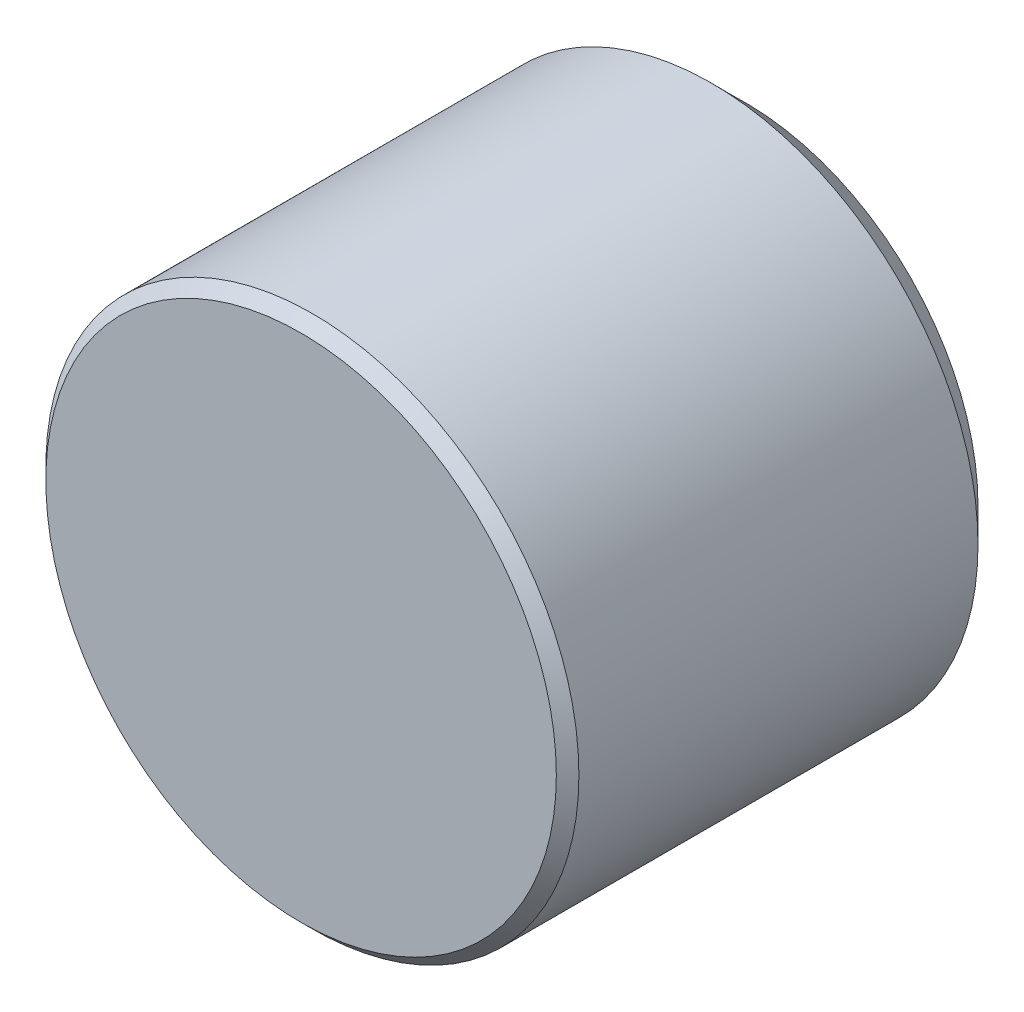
ISO-10303-21;
HEADER;
FILE_DESCRIPTION(('STEP AP214'),'2;1');
FILE_NAME('part.step','',(''),(''),'','','');
FILE_SCHEMA(('AUTOMOTIVE_DESIGN { 1 0 10303 214 1 1 1 1 }'));
ENDSEC;
DATA;
#1=APPLICATION_CONTEXT('core data for automotive mechanical design processes');
#2=APPLICATION_PROTOCOL_DEFINITION('international standard','automotive_design',2000,#1);
#3=PRODUCT_CONTEXT('',#1,'mechanical');
#4=PRODUCT('Part','Part','',(#3));
#5=PRODUCT_RELATED_PRODUCT_CATEGORY('part','',(#4));
#6=PRODUCT_DEFINITION_FORMATION('','',#4);
#7=PRODUCT_DEFINITION_CONTEXT('part definition',#1,'design');
#8=PRODUCT_DEFINITION('design','',#6,#7);
#9=PRODUCT_DEFINITION_SHAPE('','',#8);
#10=(LENGTH_UNIT() NAMED_UNIT(*) SI_UNIT(.MILLI.,.METRE.));
#11=(NAMED_UNIT(*) PLANE_ANGLE_UNIT() SI_UNIT($,.RADIAN.));
#12=(NAMED_UNIT(*) SI_UNIT($,.STERADIAN.) SOLID_ANGLE_UNIT());
#13=UNCERTAINTY_MEASURE_WITH_UNIT(LENGTH_MEASURE(1.E-05),#10,'distance_accuracy_value','');
#14=(GEOMETRIC_REPRESENTATION_CONTEXT(3) GLOBAL_UNCERTAINTY_ASSIGNED_CONTEXT((#13)) GLOBAL_UNIT_ASSIGNED_CONTEXT((#10,
#11,#12)) REPRESENTATION_CONTEXT('',''));
#15=CARTESIAN_POINT('',(0.,0.,0.));
#16=DIRECTION('',(0.,0.,1.));
#17=DIRECTION('',(1.,0.,0.));
#18=AXIS2_PLACEMENT_3D('',#15,#16,#17);
#19=CARTESIAN_POINT('',(0.,0.,0.));
#20=DIRECTION('',(0.,0.,1.));
#21=DIRECTION('',(1.,0.,0.));
#22=AXIS2_PLACEMENT_3D('',#19,#20,#21);
#23=PLANE('',#22);
#24=CARTESIAN_POINT('',(0.,0.,0.));
#25=DIRECTION('',(0.,0.,-1.));
#26=DIRECTION('',(-1.,0.,0.));
#27=AXIS2_PLACEMENT_3D('',#24,#25,#26);
#28=CIRCLE('',#27,2.5);
#29=CARTESIAN_POINT('',(-2.5,0.,0.));
#30=VERTEX_POINT('',#29);
#31=EDGE_CURVE('E33',#30,#30,#28,.T.);
#32=ORIENTED_EDGE('',*,*,#31,.F.);
#33=EDGE_LOOP('',(#32));
#34=FACE_BOUND('',#33,.T.);
#35=CARTESIAN_POINT('',(0.,0.,0.));
#36=DIRECTION('',(0.,0.,1.));
#37=DIRECTION('',(1.,0.,0.));
#38=AXIS2_PLACEMENT_3D('',#35,#36,#37);
#39=CIRCLE('',#38,5.238);
#40=CARTESIAN_POINT('',(5.238,0.,0.));
#41=VERTEX_POINT('',#40);
#42=EDGE_CURVE('E23',#41,#41,#39,.F.);
#43=ORIENTED_EDGE('',*,*,#42,.T.);
#44=EDGE_LOOP('',(#43));
#45=FACE_BOUND('',#44,.T.);
#46=ADVANCED_FACE('F12',(#34,#45),#23,.F.);
#47=CARTESIAN_POINT('',(0.,0.,10.));
#48=DIRECTION('',(0.,0.,-1.));
#49=DIRECTION('',(-1.,0.,0.));
#50=AXIS2_PLACEMENT_3D('',#47,#48,#49);
#51=CYLINDRICAL_SURFACE('',#50,6.);
#52=CARTESIAN_POINT('',(0.,0.,9.746));
#53=DIRECTION('',(0.,0.,1.));
#54=DIRECTION('',(1.,0.,0.));
#55=AXIS2_PLACEMENT_3D('',#52,#53,#54);
#56=CIRCLE('',#55,6.);
#57=CARTESIAN_POINT('',(6.,0.,9.746));
#58=VERTEX_POINT('',#57);
#59=EDGE_CURVE('E8',#58,#58,#56,.F.);
#60=ORIENTED_EDGE('',*,*,#59,.T.);
#61=EDGE_LOOP('',(#60));
#62=FACE_BOUND('',#61,.T.);
#63=CARTESIAN_POINT('',(0.,0.,0.762));
#64=DIRECTION('',(0.,0.,1.));
#65=DIRECTION('',(1.,0.,0.));
#66=AXIS2_PLACEMENT_3D('',#63,#64,#65);
#67=CIRCLE('',#66,6.);
#68=CARTESIAN_POINT('',(6.,0.,0.762));
#69=VERTEX_POINT('',#68);
#70=EDGE_CURVE('E27',#69,#69,#67,.T.);
#71=ORIENTED_EDGE('',*,*,#70,.T.);
#72=EDGE_LOOP('',(#71));
#73=FACE_BOUND('',#72,.T.);
#74=ADVANCED_FACE('F49',(#62,#73),#51,.T.);
#75=CARTESIAN_POINT('',(0.,0.,10.));
#76=DIRECTION('',(0.,0.,1.));
#77=DIRECTION('',(1.,0.,0.));
#78=AXIS2_PLACEMENT_3D('',#75,#76,#77);
#79=PLANE('',#78);
#80=CARTESIAN_POINT('',(0.,0.,10.));
#81=DIRECTION('',(0.,0.,1.));
#82=DIRECTION('',(1.,0.,0.));
#83=AXIS2_PLACEMENT_3D('',#80,#81,#82);
#84=CIRCLE('',#83,5.746);
#85=CARTESIAN_POINT('',(5.746,0.,10.));
#86=VERTEX_POINT('',#85);
#87=EDGE_CURVE('E19',#86,#86,#84,.T.);
#88=ORIENTED_EDGE('',*,*,#87,.T.);
#89=EDGE_LOOP('',(#88));
#90=FACE_BOUND('',#89,.T.);
#91=ADVANCED_FACE('F56',(#90),#79,.T.);
#92=CARTESIAN_POINT('',(0.,0.,0.762));
#93=DIRECTION('',(0.,0.,1.));
#94=DIRECTION('',(1.,0.,0.));
#95=AXIS2_PLACEMENT_3D('',#92,#93,#94);
#96=CONICAL_SURFACE('',#95,6.,0.785398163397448);
#97=ORIENTED_EDGE('',*,*,#42,.F.);
#98=EDGE_LOOP('',(#97));
#99=FACE_BOUND('',#98,.T.);
#100=ORIENTED_EDGE('',*,*,#70,.F.);
#101=EDGE_LOOP('',(#100));
#102=FACE_BOUND('',#101,.T.);
#103=ADVANCED_FACE('F53',(#99,#102),#96,.T.);
#104=CARTESIAN_POINT('',(0.,0.,10.));
#105=DIRECTION('',(0.,0.,-1.));
#106=DIRECTION('',(-1.,0.,0.));
#107=AXIS2_PLACEMENT_3D('',#104,#105,#106);
#108=CONICAL_SURFACE('',#107,5.746,0.785398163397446);
#109=ORIENTED_EDGE('',*,*,#59,.F.);
#110=EDGE_LOOP('',(#109));
#111=FACE_BOUND('',#110,.T.);
#112=ORIENTED_EDGE('',*,*,#87,.F.);
#113=EDGE_LOOP('',(#112));
#114=FACE_BOUND('',#113,.T.);
#115=ADVANCED_FACE('F14',(#111,#114),#108,.T.);
#116=CARTESIAN_POINT('',(0.,0.,5.));
#117=DIRECTION('',(0.,0.,-1.));
#118=DIRECTION('',(-1.,0.,0.));
#119=AXIS2_PLACEMENT_3D('',#116,#117,#118);
#120=CYLINDRICAL_SURFACE('',#119,2.5);
#121=CARTESIAN_POINT('',(0.,0.,5.));
#122=DIRECTION('',(0.,0.,-1.));
#123=DIRECTION('',(-1.,0.,0.));
#124=AXIS2_PLACEMENT_3D('',#121,#122,#123);
#125=CIRCLE('',#124,2.5);
#126=CARTESIAN_POINT('',(-2.5,0.,5.));
#127=VERTEX_POINT('',#126);
#128=EDGE_CURVE('E32',#127,#127,#125,.T.);
#129=ORIENTED_EDGE('',*,*,#128,.F.);
#130=EDGE_LOOP('',(#129));
#131=FACE_BOUND('',#130,.T.);
#132=ORIENTED_EDGE('',*,*,#31,.T.);
#133=EDGE_LOOP('',(#132));
#134=FACE_BOUND('',#133,.T.);
#135=ADVANCED_FACE('F41',(#131,#134),#120,.F.);
#136=CARTESIAN_POINT('',(0.,0.,5.));
#137=DIRECTION('',(0.,0.,-1.));
#138=DIRECTION('',(-1.,0.,0.));
#139=AXIS2_PLACEMENT_3D('',#136,#137,#138);
#140=PLANE('',#139);
#141=ORIENTED_EDGE('',*,*,#128,.T.);
#142=EDGE_LOOP('',(#141));
#143=FACE_BOUND('',#142,.T.);
#144=ADVANCED_FACE('F39',(#143),#140,.T.);
#145=CLOSED_SHELL('',(#46,#74,#91,#103,#115,#135,#144));
#146=MANIFOLD_SOLID_BREP('B1',#145);
#147=ADVANCED_BREP_SHAPE_REPRESENTATION('',(#18,#146),#14);
#148=SHAPE_DEFINITION_REPRESENTATION(#9,#147);
ENDSEC;
END-ISO-10303-21;
